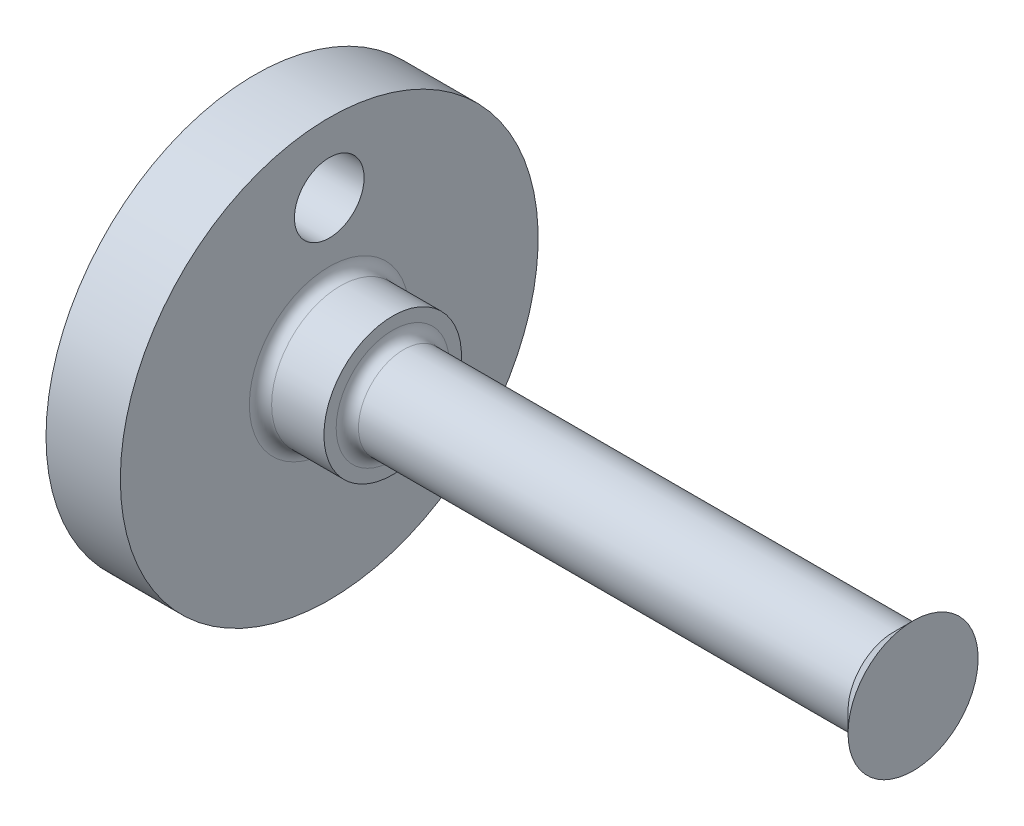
from build123d import *

# Parameters (mm, degrees)
CUT_EXTRUDE2_REACH = 24.355
SKETCH3_R          = 1.18999


with BuildPart() as part:
    # Sketch1 → Revolve1 (revolve)
    with BuildSketch(Plane.XY, mode=Mode.PRIVATE) as revolve1_sk:
        with BuildLine():
            Line((0, 0), (22.48662, 0))
            Line((22.48662, 0), (22.48662, 2.2225))
            Line((22.48662, 2.2225), (21.81352, 1.5494))
            Line((21.81352, 1.5494), (5.08762, 1.5494))
            ThreePointArc((5.08762, 1.5494), (4.818212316, 1.660992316), (4.70662, 1.9304))
            Line((4.70662, 1.9304), (4.70662, 2.3495))
            Line((4.70662, 2.3495), (2.921, 2.3495))
            ThreePointArc((2.921, 2.3495), (2.651592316, 2.461092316), (2.54, 2.7305))
            Line((2.54, 2.7305), (2.54, 7.1374))
            Line((2.54, 7.1374), (0, 7.1374))
            Line((0, 7.1374), (0, 0))
        make_face()
    revolve(revolve1_sk.sketch.rotate(Axis((0, 0, 0), (1, 0, 0)), 90), axis=Axis((0, 0, 0), (1, 0, 0)))

    # Sketch3 → Cut-Extrude2 (cut, up to next)
    with BuildSketch(Plane(origin=(2.54, 0, 0), x_dir=(0, 0, -1), z_dir=(1, 0, 0)), mode=Mode.PRIVATE) as cut_extrude2_sk1:
        with Locations((0, 4.7625)):
            Circle(SKETCH3_R)
    cut_extrude2_tool1 = extrude(cut_extrude2_sk1.sketch, amount=-CUT_EXTRUDE2_REACH, mode=Mode.PRIVATE) & part.part
    add(cut_extrude2_tool1.solids().sort_by_distance((2.54, 4.7625, 0))[0], mode=Mode.SUBTRACT)


solid = part.part
